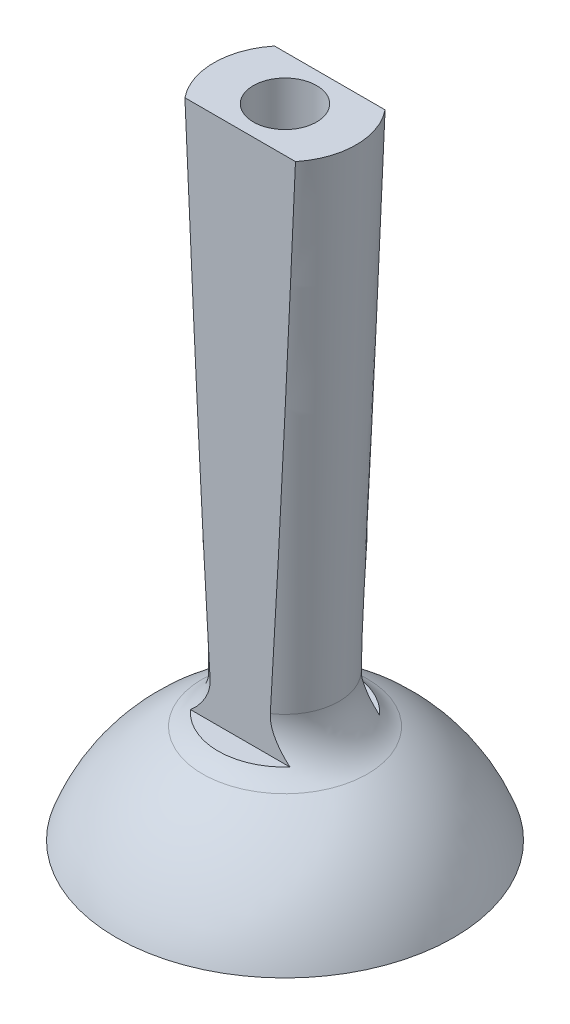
from build123d import *

# Parameters (mm, degrees)
FILLET_2_R          = 10
CUT_EXTRUDE_1_DEPTH = 100


with BuildPart() as part:
    # Sketch 1 → Revolve 1 (revolve)
    with BuildSketch(Plane.XY):
        with BuildLine():
            Line((-13.5, 90), (-10, -10))
            ThreePointArc((-10, -10), (-23.478713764, -17.903252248), (-32, -31))
            Line((-32, -31), (-27, -31))
            Line((-27, -31), (-26.984516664, -31))
            ThreePointArc((-26.984516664, -31), (-18.602771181, -19.820691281), (-6, -13.787387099))
            Line((-6, -13.787387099), (-6, -8.937387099))
            Line((-6, -8.937387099), (-6, 90))
            Line((-6, 90), (-13.5, 90))
        make_face()
    revolve(axis=Axis((0, 0, 0), (0, 1, 0)))

    # Fillet 2
    fillet_2_edges = [part.edges().sort_by_distance(p)[0] for p in [
        (10, -10, 0),
    ]]
    fillet(fillet_2_edges, radius=FILLET_2_R)

    # Sketch 2 → Cut-Extrude 1 (cut)
    with BuildSketch(Plane(origin=(0, 90, 0), x_dir=(1, 0, 0), z_dir=(0, 1, 0))):
        Polygon((0, 8.5), (19.613925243, 8.5), (19.613925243, 16.0190684), (-21.403743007, 16.0190684), (-21.403743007, 8.5), align=None)
        Polygon((-21.403743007, -16.0190684), (-21.403743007, -8.5), (0, -8.5), (19.613925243, -8.5), (19.613925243, -16.0190684), align=None)
    extrude(amount=-CUT_EXTRUDE_1_DEPTH, mode=Mode.SUBTRACT)


solid = part.part
